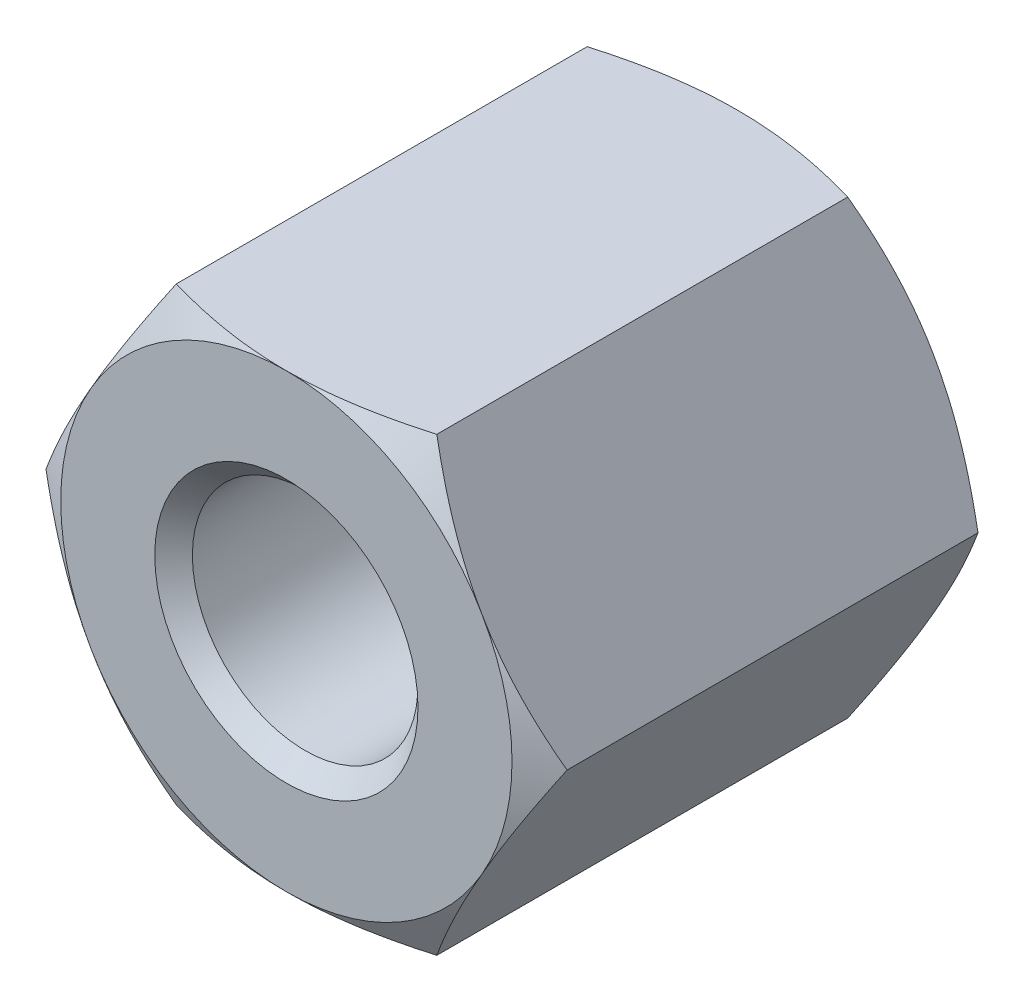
ISO-10303-21;
HEADER;
FILE_DESCRIPTION(('STEP AP214'),'2;1');
FILE_NAME('part.step','',(''),(''),'','','');
FILE_SCHEMA(('AUTOMOTIVE_DESIGN { 1 0 10303 214 1 1 1 1 }'));
ENDSEC;
DATA;
#1=APPLICATION_CONTEXT('core data for automotive mechanical design processes');
#2=APPLICATION_PROTOCOL_DEFINITION('international standard','automotive_design',2000,#1);
#3=PRODUCT_CONTEXT('',#1,'mechanical');
#4=PRODUCT('Part','Part','',(#3));
#5=PRODUCT_RELATED_PRODUCT_CATEGORY('part','',(#4));
#6=PRODUCT_DEFINITION_FORMATION('','',#4);
#7=PRODUCT_DEFINITION_CONTEXT('part definition',#1,'design');
#8=PRODUCT_DEFINITION('design','',#6,#7);
#9=PRODUCT_DEFINITION_SHAPE('','',#8);
#10=(LENGTH_UNIT() NAMED_UNIT(*) SI_UNIT(.MILLI.,.METRE.));
#11=(NAMED_UNIT(*) PLANE_ANGLE_UNIT() SI_UNIT($,.RADIAN.));
#12=(NAMED_UNIT(*) SI_UNIT($,.STERADIAN.) SOLID_ANGLE_UNIT());
#13=UNCERTAINTY_MEASURE_WITH_UNIT(LENGTH_MEASURE(1.E-05),#10,'distance_accuracy_value','');
#14=(GEOMETRIC_REPRESENTATION_CONTEXT(3) GLOBAL_UNCERTAINTY_ASSIGNED_CONTEXT((#13)) GLOBAL_UNIT_ASSIGNED_CONTEXT((#10,
#11,#12)) REPRESENTATION_CONTEXT('',''));
#15=CARTESIAN_POINT('',(0.,0.,0.));
#16=DIRECTION('',(0.,0.,1.));
#17=DIRECTION('',(1.,0.,0.));
#18=AXIS2_PLACEMENT_3D('',#15,#16,#17);
#19=CARTESIAN_POINT('',(3.46410161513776,0.,-3.));
#20=DIRECTION('',(0.866025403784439,0.5,0.));
#21=DIRECTION('',(-0.5,0.866025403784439,0.));
#22=AXIS2_PLACEMENT_3D('',#19,#20,#21);
#23=PLANE('',#22);
#24=CARTESIAN_POINT('',(3.46421708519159,-0.000199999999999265,2.73198413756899));
#25=CARTESIAN_POINT('',(3.38810199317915,0.131635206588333,2.7759462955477));
#26=CARTESIAN_POINT('',(3.31132988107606,0.26460840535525,2.81592841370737));
#27=CARTESIAN_POINT('',(3.15645624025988,0.532857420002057,2.88571791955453));
#28=CARTESIAN_POINT('',(3.078351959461,0.668138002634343,2.91550061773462));
#29=CARTESIAN_POINT('',(2.92311136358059,0.937022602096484,2.96186216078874));
#30=CARTESIAN_POINT('',(2.84599893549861,1.07058524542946,2.97874955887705));
#31=CARTESIAN_POINT('',(2.6914112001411,1.33833905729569,2.99891035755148));
#32=CARTESIAN_POINT('',(2.61393645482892,1.47252925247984,3.00220045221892));
#33=CARTESIAN_POINT('',(2.46916798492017,1.72327559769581,2.99535946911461));
#34=CARTESIAN_POINT('',(2.40185259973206,1.83986926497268,2.98690808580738));
#35=CARTESIAN_POINT('',(2.2676603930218,2.07229698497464,2.96012105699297));
#36=CARTESIAN_POINT('',(2.2007840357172,2.18813023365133,2.94177625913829));
#37=CARTESIAN_POINT('',(2.06631510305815,2.42103725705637,2.89591524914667));
#38=CARTESIAN_POINT('',(1.99873954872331,2.53808155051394,2.86820461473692));
#39=CARTESIAN_POINT('',(1.86459637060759,2.77042435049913,2.8053122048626));
#40=CARTESIAN_POINT('',(1.79802702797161,2.88572583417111,2.77014520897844));
#41=CARTESIAN_POINT('',(1.73193533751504,3.0002,2.73198413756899));
#42=B_SPLINE_CURVE_WITH_KNOTS('',3,(#24,#25,#26,#27,#28,#29,#30,#31,#32,#33,#34,#35,#36,#37,#38,
#39,#40,#41),.UNSPECIFIED.,.F.,.F.,(4,2,2,2,2,2,2,2,4),(0.,0.475539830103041,0.952222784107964,
1.41710776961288,1.88142182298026,2.28572436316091,2.69040156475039,3.10405572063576,
3.5168974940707),.UNSPECIFIED.);
#43=CARTESIAN_POINT('',(3.46410161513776,0.,2.73205080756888));
#44=VERTEX_POINT('',#43);
#45=CARTESIAN_POINT('',(2.59807621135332,1.5,3.));
#46=VERTEX_POINT('',#45);
#47=EDGE_CURVE('E127',#44,#46,#42,.T.);
#48=ORIENTED_EDGE('',*,*,#47,.F.);
#49=DIRECTION('',(0.,0.,1.));
#50=VECTOR('',#49,1.);
#51=CARTESIAN_POINT('',(3.46410161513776,0.,-3.));
#52=LINE('',#51,#50);
#53=CARTESIAN_POINT('',(3.46410161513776,0.,-2.73205080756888));
#54=VERTEX_POINT('',#53);
#55=EDGE_CURVE('E568',#54,#44,#52,.T.);
#56=ORIENTED_EDGE('',*,*,#55,.F.);
#57=CARTESIAN_POINT('',(3.46421708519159,-0.000199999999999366,-2.73198413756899));
#58=CARTESIAN_POINT('',(3.38810199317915,0.131635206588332,-2.77594629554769));
#59=CARTESIAN_POINT('',(3.31132988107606,0.26460840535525,-2.81592841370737));
#60=CARTESIAN_POINT('',(3.15645624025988,0.532857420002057,-2.88571791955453));
#61=CARTESIAN_POINT('',(3.078351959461,0.668138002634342,-2.91550061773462));
#62=CARTESIAN_POINT('',(2.92311136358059,0.937022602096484,-2.96186216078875));
#63=CARTESIAN_POINT('',(2.84599893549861,1.07058524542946,-2.97874955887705));
#64=CARTESIAN_POINT('',(2.6914112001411,1.33833905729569,-2.99891035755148));
#65=CARTESIAN_POINT('',(2.61393645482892,1.47252925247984,-3.00220045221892));
#66=CARTESIAN_POINT('',(2.46916798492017,1.72327559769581,-2.99535946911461));
#67=CARTESIAN_POINT('',(2.40185259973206,1.83986926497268,-2.98690808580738));
#68=CARTESIAN_POINT('',(2.2676603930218,2.07229698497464,-2.96012105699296));
#69=CARTESIAN_POINT('',(2.2007840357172,2.18813023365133,-2.94177625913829));
#70=CARTESIAN_POINT('',(2.06631510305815,2.42103725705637,-2.89591524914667));
#71=CARTESIAN_POINT('',(1.99873954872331,2.53808155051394,-2.86820461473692));
#72=CARTESIAN_POINT('',(1.86459637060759,2.77042435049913,-2.8053122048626));
#73=CARTESIAN_POINT('',(1.79802702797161,2.88572583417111,-2.77014520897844));
#74=CARTESIAN_POINT('',(1.73193533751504,3.0002,-2.73198413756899));
#75=B_SPLINE_CURVE_WITH_KNOTS('',3,(#57,#58,#59,#60,#61,#62,#63,#64,#65,#66,#67,#68,#69,#70,#71,
#72,#73,#74),.UNSPECIFIED.,.F.,.F.,(4,2,2,2,2,2,2,2,4),(0.,0.475539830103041,0.952222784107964,
1.41710776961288,1.88142182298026,2.28572436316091,2.69040156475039,3.10405572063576,
3.5168974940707),.UNSPECIFIED.);
#76=CARTESIAN_POINT('',(2.59807621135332,1.5,-3.));
#77=VERTEX_POINT('',#76);
#78=EDGE_CURVE('E540',#54,#77,#75,.T.);
#79=ORIENTED_EDGE('',*,*,#78,.T.);
#80=CARTESIAN_POINT('',(1.73205080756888,3.,-2.73205080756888));
#81=VERTEX_POINT('',#80);
#82=EDGE_CURVE('E269',#77,#81,#75,.T.);
#83=ORIENTED_EDGE('',*,*,#82,.T.);
#84=DIRECTION('',(0.,0.,1.));
#85=VECTOR('',#84,1.);
#86=CARTESIAN_POINT('',(1.73205080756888,3.,-3.));
#87=LINE('',#86,#85);
#88=CARTESIAN_POINT('',(1.73205080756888,3.,2.73205080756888));
#89=VERTEX_POINT('',#88);
#90=EDGE_CURVE('E159',#81,#89,#87,.T.);
#91=ORIENTED_EDGE('',*,*,#90,.T.);
#92=EDGE_CURVE('E140',#46,#89,#42,.T.);
#93=ORIENTED_EDGE('',*,*,#92,.F.);
#94=EDGE_LOOP('',(#48,#56,#79,#83,#91,#93));
#95=FACE_BOUND('',#94,.T.);
#96=ADVANCED_FACE('F41',(#95),#23,.T.);
#97=CARTESIAN_POINT('',(1.73205080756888,-3.,-3.));
#98=DIRECTION('',(0.866025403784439,-0.5,0.));
#99=DIRECTION('',(0.5,0.866025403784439,0.));
#100=AXIS2_PLACEMENT_3D('',#97,#98,#99);
#101=PLANE('',#100);
#102=CARTESIAN_POINT('',(1.73193533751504,-3.0002,2.73198413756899));
#103=CARTESIAN_POINT('',(1.80805042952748,-2.86836479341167,2.77594629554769));
#104=CARTESIAN_POINT('',(1.88482254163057,-2.73539159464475,2.81592841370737));
#105=CARTESIAN_POINT('',(2.03969618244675,-2.46714257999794,2.88571791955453));
#106=CARTESIAN_POINT('',(2.11780046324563,-2.33186199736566,2.91550061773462));
#107=CARTESIAN_POINT('',(2.27304105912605,-2.06297739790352,2.96186216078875));
#108=CARTESIAN_POINT('',(2.35015348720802,-1.92941475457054,2.97874955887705));
#109=CARTESIAN_POINT('',(2.50474122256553,-1.66166094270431,2.99891035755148));
#110=CARTESIAN_POINT('',(2.58221596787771,-1.52747074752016,3.00220045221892));
#111=CARTESIAN_POINT('',(2.72698443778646,-1.27672440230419,2.99535946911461));
#112=CARTESIAN_POINT('',(2.79429982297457,-1.16013073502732,2.98690808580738));
#113=CARTESIAN_POINT('',(2.92849202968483,-0.927703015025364,2.96012105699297));
#114=CARTESIAN_POINT('',(2.99536838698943,-0.811869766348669,2.94177625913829));
#115=CARTESIAN_POINT('',(3.12983731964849,-0.578962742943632,2.89591524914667));
#116=CARTESIAN_POINT('',(3.19741287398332,-0.461918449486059,2.86820461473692));
#117=CARTESIAN_POINT('',(3.33155605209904,-0.229575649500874,2.8053122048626));
#118=CARTESIAN_POINT('',(3.39812539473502,-0.114274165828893,2.77014520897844));
#119=CARTESIAN_POINT('',(3.46421708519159,0.000200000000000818,2.73198413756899));
#120=B_SPLINE_CURVE_WITH_KNOTS('',3,(#102,#103,#104,#105,#106,#107,#108,#109,#110,#111,#112,
#113,#114,#115,#116,#117,#118,#119),.UNSPECIFIED.,.F.,.F.,(4,2,2,2,2,2,2,2,4),(0.,
0.47553983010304,0.952222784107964,1.41710776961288,1.88142182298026,2.28572436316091,
2.69040156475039,3.10405572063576,3.5168974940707),.UNSPECIFIED.);
#121=CARTESIAN_POINT('',(1.73205080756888,-3.,2.73205080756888));
#122=VERTEX_POINT('',#121);
#123=CARTESIAN_POINT('',(2.59807621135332,-1.5,3.));
#124=VERTEX_POINT('',#123);
#125=EDGE_CURVE('E531',#122,#124,#120,.T.);
#126=ORIENTED_EDGE('',*,*,#125,.F.);
#127=DIRECTION('',(0.,0.,1.));
#128=VECTOR('',#127,1.);
#129=CARTESIAN_POINT('',(1.73205080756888,-3.,-3.));
#130=LINE('',#129,#128);
#131=CARTESIAN_POINT('',(1.73205080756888,-3.,-2.73205080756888));
#132=VERTEX_POINT('',#131);
#133=EDGE_CURVE('E283',#132,#122,#130,.T.);
#134=ORIENTED_EDGE('',*,*,#133,.F.);
#135=CARTESIAN_POINT('',(1.73193533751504,-3.0002,-2.73198413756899));
#136=CARTESIAN_POINT('',(1.80805042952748,-2.86836479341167,-2.77594629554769));
#137=CARTESIAN_POINT('',(1.88482254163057,-2.73539159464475,-2.81592841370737));
#138=CARTESIAN_POINT('',(2.03969618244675,-2.46714257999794,-2.88571791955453));
#139=CARTESIAN_POINT('',(2.11780046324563,-2.33186199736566,-2.91550061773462));
#140=CARTESIAN_POINT('',(2.27304105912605,-2.06297739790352,-2.96186216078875));
#141=CARTESIAN_POINT('',(2.35015348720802,-1.92941475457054,-2.97874955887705));
#142=CARTESIAN_POINT('',(2.50474122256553,-1.66166094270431,-2.99891035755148));
#143=CARTESIAN_POINT('',(2.58221596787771,-1.52747074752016,-3.00220045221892));
#144=CARTESIAN_POINT('',(2.72698443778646,-1.27672440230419,-2.99535946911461));
#145=CARTESIAN_POINT('',(2.79429982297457,-1.16013073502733,-2.98690808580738));
#146=CARTESIAN_POINT('',(2.92849202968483,-0.927703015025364,-2.96012105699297));
#147=CARTESIAN_POINT('',(2.99536838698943,-0.811869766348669,-2.94177625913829));
#148=CARTESIAN_POINT('',(3.12983731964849,-0.578962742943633,-2.89591524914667));
#149=CARTESIAN_POINT('',(3.19741287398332,-0.461918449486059,-2.86820461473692));
#150=CARTESIAN_POINT('',(3.33155605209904,-0.229575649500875,-2.8053122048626));
#151=CARTESIAN_POINT('',(3.39812539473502,-0.114274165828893,-2.77014520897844));
#152=CARTESIAN_POINT('',(3.46421708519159,0.000200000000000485,-2.73198413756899));
#153=B_SPLINE_CURVE_WITH_KNOTS('',3,(#135,#136,#137,#138,#139,#140,#141,#142,#143,#144,#145,
#146,#147,#148,#149,#150,#151,#152),.UNSPECIFIED.,.F.,.F.,(4,2,2,2,2,2,2,2,4),(0.,
0.47553983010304,0.952222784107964,1.41710776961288,1.88142182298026,2.28572436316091,
2.69040156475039,3.10405572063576,3.5168974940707),.UNSPECIFIED.);
#154=CARTESIAN_POINT('',(2.59807621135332,-1.5,-3.));
#155=VERTEX_POINT('',#154);
#156=EDGE_CURVE('E569',#132,#155,#153,.T.);
#157=ORIENTED_EDGE('',*,*,#156,.T.);
#158=EDGE_CURVE('E284',#155,#54,#153,.T.);
#159=ORIENTED_EDGE('',*,*,#158,.T.);
#160=ORIENTED_EDGE('',*,*,#55,.T.);
#161=EDGE_CURVE('E132',#124,#44,#120,.T.);
#162=ORIENTED_EDGE('',*,*,#161,.F.);
#163=EDGE_LOOP('',(#126,#134,#157,#159,#160,#162));
#164=FACE_BOUND('',#163,.T.);
#165=ADVANCED_FACE('F254',(#164),#101,.T.);
#166=CARTESIAN_POINT('',(-1.73205080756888,-3.,-3.));
#167=DIRECTION('',(0.,-1.,0.));
#168=DIRECTION('',(0.,0.,-1.));
#169=AXIS2_PLACEMENT_3D('',#166,#167,#168);
#170=PLANE('',#169);
#171=CARTESIAN_POINT('',(-7.74548365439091,-3.,-0.0635206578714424));
#172=CARTESIAN_POINT('',(-7.57146996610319,-3.,0.0301558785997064));
#173=CARTESIAN_POINT('',(-7.3972904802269,-3.,0.123526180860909));
#174=CARTESIAN_POINT('',(-7.0485144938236,-3.,0.309494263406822));
#175=CARTESIAN_POINT('',(-6.87391798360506,-3.,0.402092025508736));
#176=CARTESIAN_POINT('',(-6.52407229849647,-3.,0.58643402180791));
#177=CARTESIAN_POINT('',(-6.34882267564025,-3.,0.678177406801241));
#178=CARTESIAN_POINT('',(-5.99771962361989,-3.,0.860498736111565));
#179=CARTESIAN_POINT('',(-5.82186619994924,-3.,0.951076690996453));
#180=CARTESIAN_POINT('',(-5.46231182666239,-3.,1.13439221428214));
#181=CARTESIAN_POINT('',(-5.27858020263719,-3.,1.22706972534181));
#182=CARTESIAN_POINT('',(-4.91010340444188,-3.,1.41038621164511));
#183=CARTESIAN_POINT('',(-4.72535824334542,-3.,1.50102521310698));
#184=CARTESIAN_POINT('',(-4.35463989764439,-3.,1.67959630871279));
#185=CARTESIAN_POINT('',(-4.16866716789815,-3.,1.76752934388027));
#186=CARTESIAN_POINT('',(-3.79507118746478,-3.,1.93980441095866));
#187=CARTESIAN_POINT('',(-3.60744803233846,-3.,2.02414664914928));
#188=CARTESIAN_POINT('',(-3.21921577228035,-3.,2.19262921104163));
#189=CARTESIAN_POINT('',(-3.0184798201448,-3.,2.27647962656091));
#190=CARTESIAN_POINT('',(-2.61381768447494,-3.,2.43638442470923));
#191=CARTESIAN_POINT('',(-2.40989060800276,-3.,2.51243657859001));
#192=CARTESIAN_POINT('',(-2.00053042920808,-3.,2.65237011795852));
#193=CARTESIAN_POINT('',(-1.79514384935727,-3.,2.71638511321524));
#194=CARTESIAN_POINT('',(-1.38002064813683,-3.,2.8284619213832));
#195=CARTESIAN_POINT('',(-1.17028662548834,-3.,2.87653298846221));
#196=CARTESIAN_POINT('',(-0.794006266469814,-3.,2.94264508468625));
#197=CARTESIAN_POINT('',(-0.628232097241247,-3.,2.96498768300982));
#198=CARTESIAN_POINT('',(-0.295337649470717,-3.,2.99421350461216));
#199=CARTESIAN_POINT('',(-0.128217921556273,-3.,3.00110275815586));
#200=CARTESIAN_POINT('',(0.206103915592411,-3.,2.99860539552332));
#201=CARTESIAN_POINT('',(0.373305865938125,-3.,2.98919838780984));
#202=CARTESIAN_POINT('',(0.706141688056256,-3.,2.95518699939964));
#203=CARTESIAN_POINT('',(0.871775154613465,-3.,2.93057879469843));
#204=CARTESIAN_POINT('',(1.2182340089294,-3.,2.86528769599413));
#205=CARTESIAN_POINT('',(1.39878062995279,-3.,2.82316231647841));
#206=CARTESIAN_POINT('',(1.75671584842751,-3.,2.72698316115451));
#207=CARTESIAN_POINT('',(1.93410214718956,-3.,2.67292105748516));
#208=CARTESIAN_POINT('',(2.28638755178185,-3.,2.55591066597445));
#209=CARTESIAN_POINT('',(2.46127894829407,-3.,2.49293952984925));
#210=CARTESIAN_POINT('',(2.80855860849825,-3.,2.36062387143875));
#211=CARTESIAN_POINT('',(2.98094745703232,-3.,2.29128086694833));
#212=CARTESIAN_POINT('',(3.32628458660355,-3.,2.14684908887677));
#213=CARTESIAN_POINT('',(3.49920347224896,-3.,2.07169053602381));
#214=CARTESIAN_POINT('',(3.84343885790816,-3.,1.91779095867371));
#215=CARTESIAN_POINT('',(4.01475529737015,-3.,1.83904979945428));
#216=CARTESIAN_POINT('',(4.35585639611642,-3.,1.67898476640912));
#217=CARTESIAN_POINT('',(4.52564298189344,-3.,1.597664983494));
#218=CARTESIAN_POINT('',(4.86420703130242,-3.,1.43294915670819));
#219=CARTESIAN_POINT('',(5.03298447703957,-3.,1.34955307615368));
#220=CARTESIAN_POINT('',(5.4174896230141,-3.,1.1572542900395));
#221=CARTESIAN_POINT('',(5.63295451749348,-3.,1.04782684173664));
#222=CARTESIAN_POINT('',(6.06286115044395,-3.,0.826981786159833));
#223=CARTESIAN_POINT('',(6.27730288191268,-3.,0.715564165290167));
#224=CARTESIAN_POINT('',(6.70107258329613,-3.,0.493473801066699));
#225=CARTESIAN_POINT('',(6.91041645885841,-3.,0.382831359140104));
#226=CARTESIAN_POINT('',(7.32841241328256,-3.,0.160428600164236));
#227=CARTESIAN_POINT('',(7.53706471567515,-3.,0.0486687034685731));
#228=CARTESIAN_POINT('',(7.74548365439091,-3.,-0.0635206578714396));
#229=B_SPLINE_CURVE_WITH_KNOTS('',3,(#171,#172,#173,#174,#175,#176,#177,#178,#179,#180,#181,
#182,#183,#184,#185,#186,#187,#188,#189,#190,#191,#192,#193,#194,#195,#196,#197,#198,#199,#200,
#201,#202,#203,#204,#205,#206,#207,#208,#209,#210,#211,#212,#213,#214,#215,#216,#217,#218,#219,
#220,#221,#222,#223,#224,#225,#226,#227,#228),.UNSPECIFIED.,.F.,.F.,(4,2,2,2,2,2,2,2,2,2,2,2,2,
2,2,2,2,2,2,2,2,2,2,2,2,2,2,2,4),(0.,0.592879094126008,1.18577210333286,1.77920221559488,
2.37262694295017,2.98996472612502,3.60729456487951,4.22440723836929,4.8414844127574,
5.4940087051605,6.14671897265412,6.79169049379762,7.43628700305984,7.93748287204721,
8.43848312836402,8.94011073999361,9.44186459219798,9.99750279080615,10.5535298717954,
11.1110097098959,11.6683570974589,12.2339427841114,12.7995497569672,13.3643003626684,
13.9290609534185,14.6540258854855,15.3789957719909,16.0893434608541,16.7994333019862),.UNSPECIFIED.);
#230=CARTESIAN_POINT('',(-1.73205080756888,-3.,2.73205080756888));
#231=VERTEX_POINT('',#230);
#232=CARTESIAN_POINT('',(0.,-3.,3.));
#233=VERTEX_POINT('',#232);
#234=EDGE_CURVE('E555',#231,#233,#229,.T.);
#235=ORIENTED_EDGE('',*,*,#234,.F.);
#236=DIRECTION('',(0.,0.,1.));
#237=VECTOR('',#236,1.);
#238=CARTESIAN_POINT('',(-1.73205080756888,-3.,-3.));
#239=LINE('',#238,#237);
#240=CARTESIAN_POINT('',(-1.73205080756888,-3.,-2.73205080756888));
#241=VERTEX_POINT('',#240);
#242=EDGE_CURVE('E557',#241,#231,#239,.T.);
#243=ORIENTED_EDGE('',*,*,#242,.F.);
#244=CARTESIAN_POINT('',(-6.16788179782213,-3.,-0.772136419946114));
#245=CARTESIAN_POINT('',(-6.02422581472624,-3.,-0.846712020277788));
#246=CARTESIAN_POINT('',(-5.88037224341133,-3.,-0.920910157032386));
#247=CARTESIAN_POINT('',(-5.59217732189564,-3.,-1.0683582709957));
#248=CARTESIAN_POINT('',(-5.44783596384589,-3.,-1.14160823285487));
#249=CARTESIAN_POINT('',(-5.15834899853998,-3.,-1.28707916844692));
#250=CARTESIAN_POINT('',(-5.01320248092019,-3.,-1.35929833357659));
#251=CARTESIAN_POINT('',(-4.7222107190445,-3.,-1.50232217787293));
#252=CARTESIAN_POINT('',(-4.57636546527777,-3.,-1.57312683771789));
#253=CARTESIAN_POINT('',(-4.27572207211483,-3.,-1.71685048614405));
#254=CARTESIAN_POINT('',(-4.12087581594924,-3.,-1.78966909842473));
#255=CARTESIAN_POINT('',(-3.81002771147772,-3.,-1.93279422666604));
#256=CARTESIAN_POINT('',(-3.65402589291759,-3.,-2.00310080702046));
#257=CARTESIAN_POINT('',(-3.34069233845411,-3.,-2.14040926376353));
#258=CARTESIAN_POINT('',(-3.18336157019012,-3.,-2.20741333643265));
#259=CARTESIAN_POINT('',(-2.86689802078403,-3.,-2.33714761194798));
#260=CARTESIAN_POINT('',(-2.70776485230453,-3.,-2.39987687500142));
#261=CARTESIAN_POINT('',(-2.36683864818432,-3.,-2.52728930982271));
#262=CARTESIAN_POINT('',(-2.18475109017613,-3.,-2.59119583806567));
#263=CARTESIAN_POINT('',(-1.81738028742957,-3.,-2.7088910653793));
#264=CARTESIAN_POINT('',(-1.632098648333,-3.,-2.76268469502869));
#265=CARTESIAN_POINT('',(-1.26165659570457,-3.,-2.85547519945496));
#266=CARTESIAN_POINT('',(-1.07656745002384,-3.,-2.89474576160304));
#267=CARTESIAN_POINT('',(-0.796849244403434,-3.,-2.94068610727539));
#268=CARTESIAN_POINT('',(-0.70327251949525,-3.,-2.95383792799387));
#269=CARTESIAN_POINT('',(-0.515580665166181,-3.,-2.97540852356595));
#270=CARTESIAN_POINT('',(-0.421465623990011,-3.,-2.98382805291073));
#271=CARTESIAN_POINT('',(-0.231434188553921,-3.,-2.99572308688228));
#272=CARTESIAN_POINT('',(-0.135512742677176,-3.,-2.99911875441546));
#273=CARTESIAN_POINT('',(0.0563707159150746,-3.,-3.00057990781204));
#274=CARTESIAN_POINT('',(0.152332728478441,-3.,-2.9986454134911));
#275=CARTESIAN_POINT('',(0.344018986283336,-3.,-2.98952155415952));
#276=CARTESIAN_POINT('',(0.439743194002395,-3.,-2.98233140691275));
#277=CARTESIAN_POINT('',(0.630692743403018,-3.,-2.96297149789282));
#278=CARTESIAN_POINT('',(0.725917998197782,-3.,-2.95080089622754));
#279=CARTESIAN_POINT('',(1.01449835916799,-3.,-2.90682401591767));
#280=CARTESIAN_POINT('',(1.20676490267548,-3.,-2.86776877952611));
#281=CARTESIAN_POINT('',(1.58764028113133,-3.,-2.77495872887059));
#282=CARTESIAN_POINT('',(1.77624758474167,-3.,-2.72119789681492));
#283=CARTESIAN_POINT('',(2.15226695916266,-3.,-2.60232311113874));
#284=CARTESIAN_POINT('',(2.33963795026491,-3.,-2.53708140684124));
#285=CARTESIAN_POINT('',(2.71150558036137,-3.,-2.39881044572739));
#286=CARTESIAN_POINT('',(2.89600132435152,-3.,-2.32577881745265));
#287=CARTESIAN_POINT('',(3.26290797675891,-3.,-2.17404494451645));
#288=CARTESIAN_POINT('',(3.44531585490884,-3.,-2.09533543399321));
#289=CARTESIAN_POINT('',(3.80828668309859,-3.,-1.93385588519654));
#290=CARTESIAN_POINT('',(3.98884986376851,-3.,-1.85108636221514));
#291=CARTESIAN_POINT('',(4.33752623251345,-3.,-1.68768839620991));
#292=CARTESIAN_POINT('',(4.50572404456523,-3.,-1.60723977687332));
#293=CARTESIAN_POINT('',(4.84112403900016,-3.,-1.44428125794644));
#294=CARTESIAN_POINT('',(5.00832618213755,-3.,-1.36177127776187));
#295=CARTESIAN_POINT('',(5.34129694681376,-3.,-1.19545697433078));
#296=CARTESIAN_POINT('',(5.50706859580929,-3.,-1.1116586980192));
#297=CARTESIAN_POINT('',(5.83793978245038,-3.,-0.942782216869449));
#298=CARTESIAN_POINT('',(6.00303938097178,-3.,-0.857704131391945));
#299=CARTESIAN_POINT('',(6.16788179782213,-3.,-0.772136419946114));
#300=B_SPLINE_CURVE_WITH_KNOTS('',3,(#244,#245,#246,#247,#248,#249,#250,#251,#252,#253,#254,
#255,#256,#257,#258,#259,#260,#261,#262,#263,#264,#265,#266,#267,#268,#269,#270,#271,#272,#273,
#274,#275,#276,#277,#278,#279,#280,#281,#282,#283,#284,#285,#286,#287,#288,#289,#290,#291,#292,
#293,#294,#295,#296,#297,#298,#299),.UNSPECIFIED.,.F.,.F.,(4,2,2,2,2,2,2,2,2,2,2,2,2,2,2,2,2,2,
2,2,2,2,2,2,2,2,2,4),(0.,0.485580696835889,0.971169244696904,1.45752499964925,1.94388739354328,
2.45721116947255,2.97052177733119,3.48348627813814,3.99656318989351,4.57527710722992,
5.15370813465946,5.72060393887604,6.0039913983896,6.28733366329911,6.57513204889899,
6.86292936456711,7.15076952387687,7.43865824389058,8.02637689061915,8.61433640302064,
9.20930790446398,9.80446105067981,10.4003897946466,10.9962430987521,11.5555668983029,
12.1149126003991,12.6721511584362,13.2293380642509),.UNSPECIFIED.);
#301=CARTESIAN_POINT('',(0.,-3.,-3.));
#302=VERTEX_POINT('',#301);
#303=EDGE_CURVE('E565',#241,#302,#300,.T.);
#304=ORIENTED_EDGE('',*,*,#303,.T.);
#305=EDGE_CURVE('E259',#302,#132,#300,.T.);
#306=ORIENTED_EDGE('',*,*,#305,.T.);
#307=ORIENTED_EDGE('',*,*,#133,.T.);
#308=EDGE_CURVE('E138',#233,#122,#229,.T.);
#309=ORIENTED_EDGE('',*,*,#308,.F.);
#310=EDGE_LOOP('',(#235,#243,#304,#306,#307,#309));
#311=FACE_BOUND('',#310,.T.);
#312=ADVANCED_FACE('F292',(#311),#170,.T.);
#313=CARTESIAN_POINT('',(-3.46410161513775,0.,-3.));
#314=DIRECTION('',(-0.866025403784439,-0.5,0.));
#315=DIRECTION('',(0.5,-0.866025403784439,0.));
#316=AXIS2_PLACEMENT_3D('',#313,#314,#315);
#317=PLANE('',#316);
#318=CARTESIAN_POINT('',(-3.46421708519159,0.000200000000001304,2.73198413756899));
#319=CARTESIAN_POINT('',(-3.38810199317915,-0.131635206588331,2.7759462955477));
#320=CARTESIAN_POINT('',(-3.31132988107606,-0.264608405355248,2.81592841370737));
#321=CARTESIAN_POINT('',(-3.15645624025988,-0.532857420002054,2.88571791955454));
#322=CARTESIAN_POINT('',(-3.078351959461,-0.66813800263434,2.91550061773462));
#323=CARTESIAN_POINT('',(-2.92311136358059,-0.937022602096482,2.96186216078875));
#324=CARTESIAN_POINT('',(-2.84599893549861,-1.07058524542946,2.97874955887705));
#325=CARTESIAN_POINT('',(-2.6914112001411,-1.33833905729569,2.99891035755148));
#326=CARTESIAN_POINT('',(-2.61393645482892,-1.47252925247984,3.00220045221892));
#327=CARTESIAN_POINT('',(-2.46916798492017,-1.72327559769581,2.99535946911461));
#328=CARTESIAN_POINT('',(-2.40185259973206,-1.83986926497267,2.98690808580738));
#329=CARTESIAN_POINT('',(-2.2676603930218,-2.07229698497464,2.96012105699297));
#330=CARTESIAN_POINT('',(-2.2007840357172,-2.18813023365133,2.94177625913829));
#331=CARTESIAN_POINT('',(-2.06631510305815,-2.42103725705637,2.89591524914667));
#332=CARTESIAN_POINT('',(-1.99873954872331,-2.53808155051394,2.86820461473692));
#333=CARTESIAN_POINT('',(-1.86459637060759,-2.77042435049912,2.8053122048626));
#334=CARTESIAN_POINT('',(-1.79802702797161,-2.88572583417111,2.77014520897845));
#335=CARTESIAN_POINT('',(-1.73193533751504,-3.0002,2.73198413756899));
#336=B_SPLINE_CURVE_WITH_KNOTS('',3,(#318,#319,#320,#321,#322,#323,#324,#325,#326,#327,#328,
#329,#330,#331,#332,#333,#334,#335),.UNSPECIFIED.,.F.,.F.,(4,2,2,2,2,2,2,2,4),(0.,
0.475539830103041,0.952222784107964,1.41710776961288,1.88142182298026,2.28572436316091,
2.69040156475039,3.10405572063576,3.5168974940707),.UNSPECIFIED.);
#337=CARTESIAN_POINT('',(-3.46410161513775,0.,2.73205080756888));
#338=VERTEX_POINT('',#337);
#339=CARTESIAN_POINT('',(-2.59807621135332,-1.5,3.));
#340=VERTEX_POINT('',#339);
#341=EDGE_CURVE('E176',#338,#340,#336,.T.);
#342=ORIENTED_EDGE('',*,*,#341,.F.);
#343=DIRECTION('',(0.,0.,1.));
#344=VECTOR('',#343,1.);
#345=CARTESIAN_POINT('',(-3.46410161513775,0.,-3.));
#346=LINE('',#345,#344);
#347=CARTESIAN_POINT('',(-3.46410161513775,0.,-2.73205080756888));
#348=VERTEX_POINT('',#347);
#349=EDGE_CURVE('E552',#348,#338,#346,.T.);
#350=ORIENTED_EDGE('',*,*,#349,.F.);
#351=CARTESIAN_POINT('',(-3.46421708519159,0.000200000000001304,-2.73198413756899));
#352=CARTESIAN_POINT('',(-3.38810199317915,-0.131635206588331,-2.7759462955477));
#353=CARTESIAN_POINT('',(-3.31132988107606,-0.264608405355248,-2.81592841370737));
#354=CARTESIAN_POINT('',(-3.15645624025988,-0.532857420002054,-2.88571791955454));
#355=CARTESIAN_POINT('',(-3.078351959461,-0.66813800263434,-2.91550061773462));
#356=CARTESIAN_POINT('',(-2.92311136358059,-0.937022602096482,-2.96186216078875));
#357=CARTESIAN_POINT('',(-2.84599893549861,-1.07058524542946,-2.97874955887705));
#358=CARTESIAN_POINT('',(-2.6914112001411,-1.33833905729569,-2.99891035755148));
#359=CARTESIAN_POINT('',(-2.61393645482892,-1.47252925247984,-3.00220045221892));
#360=CARTESIAN_POINT('',(-2.46916798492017,-1.72327559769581,-2.99535946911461));
#361=CARTESIAN_POINT('',(-2.40185259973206,-1.83986926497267,-2.98690808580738));
#362=CARTESIAN_POINT('',(-2.2676603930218,-2.07229698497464,-2.96012105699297));
#363=CARTESIAN_POINT('',(-2.2007840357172,-2.18813023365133,-2.94177625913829));
#364=CARTESIAN_POINT('',(-2.06631510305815,-2.42103725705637,-2.89591524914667));
#365=CARTESIAN_POINT('',(-1.99873954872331,-2.53808155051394,-2.86820461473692));
#366=CARTESIAN_POINT('',(-1.86459637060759,-2.77042435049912,-2.8053122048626));
#367=CARTESIAN_POINT('',(-1.79802702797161,-2.88572583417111,-2.77014520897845));
#368=CARTESIAN_POINT('',(-1.73193533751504,-3.0002,-2.73198413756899));
#369=B_SPLINE_CURVE_WITH_KNOTS('',3,(#351,#352,#353,#354,#355,#356,#357,#358,#359,#360,#361,
#362,#363,#364,#365,#366,#367,#368),.UNSPECIFIED.,.F.,.F.,(4,2,2,2,2,2,2,2,4),(0.,
0.475539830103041,0.952222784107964,1.41710776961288,1.88142182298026,2.28572436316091,
2.69040156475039,3.10405572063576,3.5168974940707),.UNSPECIFIED.);
#370=CARTESIAN_POINT('',(-2.59807621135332,-1.5,-3.));
#371=VERTEX_POINT('',#370);
#372=EDGE_CURVE('E275',#348,#371,#369,.T.);
#373=ORIENTED_EDGE('',*,*,#372,.T.);
#374=EDGE_CURVE('E282',#371,#241,#369,.T.);
#375=ORIENTED_EDGE('',*,*,#374,.T.);
#376=ORIENTED_EDGE('',*,*,#242,.T.);
#377=EDGE_CURVE('E539',#340,#231,#336,.T.);
#378=ORIENTED_EDGE('',*,*,#377,.F.);
#379=EDGE_LOOP('',(#342,#350,#373,#375,#376,#378));
#380=FACE_BOUND('',#379,.T.);
#381=ADVANCED_FACE('F289',(#380),#317,.T.);
#382=CARTESIAN_POINT('',(-1.73205080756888,3.,-3.));
#383=DIRECTION('',(-0.866025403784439,0.5,0.));
#384=DIRECTION('',(-0.5,-0.866025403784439,0.));
#385=AXIS2_PLACEMENT_3D('',#382,#383,#384);
#386=PLANE('',#385);
#387=CARTESIAN_POINT('',(-1.73193533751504,3.0002,2.73198413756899));
#388=CARTESIAN_POINT('',(-1.80805042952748,2.86836479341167,2.77594629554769));
#389=CARTESIAN_POINT('',(-1.88482254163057,2.73539159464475,2.81592841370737));
#390=CARTESIAN_POINT('',(-2.03969618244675,2.46714257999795,2.88571791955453));
#391=CARTESIAN_POINT('',(-2.11780046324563,2.33186199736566,2.91550061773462));
#392=CARTESIAN_POINT('',(-2.27304105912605,2.06297739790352,2.96186216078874));
#393=CARTESIAN_POINT('',(-2.35015348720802,1.92941475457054,2.97874955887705));
#394=CARTESIAN_POINT('',(-2.50474122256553,1.66166094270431,2.99891035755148));
#395=CARTESIAN_POINT('',(-2.58221596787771,1.52747074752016,3.00220045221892));
#396=CARTESIAN_POINT('',(-2.72698443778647,1.27672440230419,2.99535946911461));
#397=CARTESIAN_POINT('',(-2.79429982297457,1.16013073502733,2.98690808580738));
#398=CARTESIAN_POINT('',(-2.92849202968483,0.927703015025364,2.96012105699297));
#399=CARTESIAN_POINT('',(-2.99536838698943,0.81186976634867,2.94177625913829));
#400=CARTESIAN_POINT('',(-3.12983731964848,0.578962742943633,2.89591524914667));
#401=CARTESIAN_POINT('',(-3.19741287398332,0.46191844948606,2.86820461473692));
#402=CARTESIAN_POINT('',(-3.33155605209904,0.229575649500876,2.8053122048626));
#403=CARTESIAN_POINT('',(-3.39812539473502,0.114274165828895,2.77014520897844));
#404=CARTESIAN_POINT('',(-3.46421708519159,-0.000199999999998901,2.73198413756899));
#405=B_SPLINE_CURVE_WITH_KNOTS('',3,(#387,#388,#389,#390,#391,#392,#393,#394,#395,#396,#397,
#398,#399,#400,#401,#402,#403,#404),.UNSPECIFIED.,.F.,.F.,(4,2,2,2,2,2,2,2,4),(0.,
0.475539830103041,0.952222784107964,1.41710776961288,1.88142182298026,2.28572436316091,
2.69040156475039,3.10405572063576,3.5168974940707),.UNSPECIFIED.);
#406=CARTESIAN_POINT('',(-1.73205080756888,3.,2.73205080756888));
#407=VERTEX_POINT('',#406);
#408=CARTESIAN_POINT('',(-2.59807621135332,1.5,3.));
#409=VERTEX_POINT('',#408);
#410=EDGE_CURVE('E183',#407,#409,#405,.T.);
#411=ORIENTED_EDGE('',*,*,#410,.F.);
#412=DIRECTION('',(0.,0.,1.));
#413=VECTOR('',#412,1.);
#414=CARTESIAN_POINT('',(-1.73205080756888,3.,-3.));
#415=LINE('',#414,#413);
#416=CARTESIAN_POINT('',(-1.73205080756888,3.,-2.73205080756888));
#417=VERTEX_POINT('',#416);
#418=EDGE_CURVE('E233',#417,#407,#415,.T.);
#419=ORIENTED_EDGE('',*,*,#418,.F.);
#420=CARTESIAN_POINT('',(-1.73193533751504,3.0002,-2.73198413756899));
#421=CARTESIAN_POINT('',(-1.80805042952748,2.86836479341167,-2.77594629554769));
#422=CARTESIAN_POINT('',(-1.88482254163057,2.73539159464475,-2.81592841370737));
#423=CARTESIAN_POINT('',(-2.03969618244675,2.46714257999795,-2.88571791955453));
#424=CARTESIAN_POINT('',(-2.11780046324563,2.33186199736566,-2.91550061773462));
#425=CARTESIAN_POINT('',(-2.27304105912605,2.06297739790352,-2.96186216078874));
#426=CARTESIAN_POINT('',(-2.35015348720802,1.92941475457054,-2.97874955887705));
#427=CARTESIAN_POINT('',(-2.50474122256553,1.66166094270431,-2.99891035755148));
#428=CARTESIAN_POINT('',(-2.58221596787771,1.52747074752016,-3.00220045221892));
#429=CARTESIAN_POINT('',(-2.72698443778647,1.27672440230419,-2.99535946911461));
#430=CARTESIAN_POINT('',(-2.79429982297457,1.16013073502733,-2.98690808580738));
#431=CARTESIAN_POINT('',(-2.92849202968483,0.927703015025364,-2.96012105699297));
#432=CARTESIAN_POINT('',(-2.99536838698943,0.81186976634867,-2.94177625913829));
#433=CARTESIAN_POINT('',(-3.12983731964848,0.578962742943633,-2.89591524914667));
#434=CARTESIAN_POINT('',(-3.19741287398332,0.46191844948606,-2.86820461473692));
#435=CARTESIAN_POINT('',(-3.33155605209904,0.229575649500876,-2.8053122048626));
#436=CARTESIAN_POINT('',(-3.39812539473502,0.114274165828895,-2.77014520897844));
#437=CARTESIAN_POINT('',(-3.46421708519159,-0.000199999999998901,-2.73198413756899));
#438=B_SPLINE_CURVE_WITH_KNOTS('',3,(#420,#421,#422,#423,#424,#425,#426,#427,#428,#429,#430,
#431,#432,#433,#434,#435,#436,#437),.UNSPECIFIED.,.F.,.F.,(4,2,2,2,2,2,2,2,4),(0.,
0.475539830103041,0.952222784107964,1.41710776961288,1.88142182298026,2.28572436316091,
2.69040156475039,3.10405572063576,3.5168974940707),.UNSPECIFIED.);
#439=CARTESIAN_POINT('',(-2.59807621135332,1.5,-3.));
#440=VERTEX_POINT('',#439);
#441=EDGE_CURVE('E237',#417,#440,#438,.T.);
#442=ORIENTED_EDGE('',*,*,#441,.T.);
#443=EDGE_CURVE('E550',#440,#348,#438,.T.);
#444=ORIENTED_EDGE('',*,*,#443,.T.);
#445=ORIENTED_EDGE('',*,*,#349,.T.);
#446=EDGE_CURVE('E527',#409,#338,#405,.T.);
#447=ORIENTED_EDGE('',*,*,#446,.F.);
#448=EDGE_LOOP('',(#411,#419,#442,#444,#445,#447));
#449=FACE_BOUND('',#448,.T.);
#450=ADVANCED_FACE('F218',(#449),#386,.T.);
#451=CARTESIAN_POINT('',(1.73205080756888,3.,-3.));
#452=DIRECTION('',(0.,1.,0.));
#453=DIRECTION('',(-1.,0.,0.));
#454=AXIS2_PLACEMENT_3D('',#451,#452,#453);
#455=PLANE('',#454);
#456=CARTESIAN_POINT('',(7.74548365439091,3.,-0.0635206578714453));
#457=CARTESIAN_POINT('',(7.57146996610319,3.,0.0301558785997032));
#458=CARTESIAN_POINT('',(7.39729048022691,3.,0.123526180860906));
#459=CARTESIAN_POINT('',(7.04851449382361,3.,0.309494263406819));
#460=CARTESIAN_POINT('',(6.87391798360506,3.,0.402092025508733));
#461=CARTESIAN_POINT('',(6.52407229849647,3.,0.586434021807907));
#462=CARTESIAN_POINT('',(6.34882267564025,3.,0.678177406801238));
#463=CARTESIAN_POINT('',(5.99771962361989,3.,0.860498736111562));
#464=CARTESIAN_POINT('',(5.82186619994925,3.,0.95107669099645));
#465=CARTESIAN_POINT('',(5.46231182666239,3.,1.13439221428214));
#466=CARTESIAN_POINT('',(5.27858020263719,3.,1.22706972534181));
#467=CARTESIAN_POINT('',(4.91010340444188,3.,1.41038621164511));
#468=CARTESIAN_POINT('',(4.72535824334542,3.,1.50102521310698));
#469=CARTESIAN_POINT('',(4.3546398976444,3.,1.67959630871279));
#470=CARTESIAN_POINT('',(4.16866716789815,3.,1.76752934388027));
#471=CARTESIAN_POINT('',(3.79507118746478,3.,1.93980441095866));
#472=CARTESIAN_POINT('',(3.60744803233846,3.,2.02414664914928));
#473=CARTESIAN_POINT('',(3.21921577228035,3.,2.19262921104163));
#474=CARTESIAN_POINT('',(3.01847982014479,3.,2.27647962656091));
#475=CARTESIAN_POINT('',(2.61381768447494,3.,2.43638442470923));
#476=CARTESIAN_POINT('',(2.40989060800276,3.,2.51243657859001));
#477=CARTESIAN_POINT('',(2.00053042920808,3.,2.65237011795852));
#478=CARTESIAN_POINT('',(1.79514384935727,3.,2.71638511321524));
#479=CARTESIAN_POINT('',(1.38002064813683,3.,2.8284619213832));
#480=CARTESIAN_POINT('',(1.17028662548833,3.,2.87653298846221));
#481=CARTESIAN_POINT('',(0.794006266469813,3.,2.94264508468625));
#482=CARTESIAN_POINT('',(0.628232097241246,3.,2.96498768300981));
#483=CARTESIAN_POINT('',(0.295337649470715,3.,2.99421350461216));
#484=CARTESIAN_POINT('',(0.128217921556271,3.,3.00110275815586));
#485=CARTESIAN_POINT('',(-0.206103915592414,3.,2.99860539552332));
#486=CARTESIAN_POINT('',(-0.373305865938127,3.,2.98919838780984));
#487=CARTESIAN_POINT('',(-0.706141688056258,3.,2.95518699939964));
#488=CARTESIAN_POINT('',(-0.871775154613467,3.,2.93057879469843));
#489=CARTESIAN_POINT('',(-1.21823400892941,3.,2.86528769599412));
#490=CARTESIAN_POINT('',(-1.39878062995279,3.,2.82316231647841));
#491=CARTESIAN_POINT('',(-1.75671584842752,3.,2.72698316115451));
#492=CARTESIAN_POINT('',(-1.93410214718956,3.,2.67292105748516));
#493=CARTESIAN_POINT('',(-2.28638755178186,3.,2.55591066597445));
#494=CARTESIAN_POINT('',(-2.46127894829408,3.,2.49293952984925));
#495=CARTESIAN_POINT('',(-2.80855860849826,3.,2.36062387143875));
#496=CARTESIAN_POINT('',(-2.98094745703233,3.,2.29128086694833));
#497=CARTESIAN_POINT('',(-3.32628458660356,3.,2.14684908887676));
#498=CARTESIAN_POINT('',(-3.49920347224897,3.,2.0716905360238));
#499=CARTESIAN_POINT('',(-3.84343885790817,3.,1.91779095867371));
#500=CARTESIAN_POINT('',(-4.01475529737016,3.,1.83904979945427));
#501=CARTESIAN_POINT('',(-4.35585639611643,3.,1.67898476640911));
#502=CARTESIAN_POINT('',(-4.52564298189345,3.,1.597664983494));
#503=CARTESIAN_POINT('',(-4.86420703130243,3.,1.43294915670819));
#504=CARTESIAN_POINT('',(-5.03298447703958,3.,1.34955307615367));
#505=CARTESIAN_POINT('',(-5.41748962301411,3.,1.15725429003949));
#506=CARTESIAN_POINT('',(-5.6329545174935,3.,1.04782684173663));
#507=CARTESIAN_POINT('',(-6.06286115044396,3.,0.826981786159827));
#508=CARTESIAN_POINT('',(-6.27730288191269,3.,0.715564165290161));
#509=CARTESIAN_POINT('',(-6.70107258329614,3.,0.493473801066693));
#510=CARTESIAN_POINT('',(-6.91041645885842,3.,0.382831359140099));
#511=CARTESIAN_POINT('',(-7.32841241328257,3.,0.160428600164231));
#512=CARTESIAN_POINT('',(-7.53706471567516,3.,0.0486687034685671));
#513=CARTESIAN_POINT('',(-7.74548365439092,3.,-0.0635206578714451));
#514=B_SPLINE_CURVE_WITH_KNOTS('',3,(#456,#457,#458,#459,#460,#461,#462,#463,#464,#465,#466,
#467,#468,#469,#470,#471,#472,#473,#474,#475,#476,#477,#478,#479,#480,#481,#482,#483,#484,#485,
#486,#487,#488,#489,#490,#491,#492,#493,#494,#495,#496,#497,#498,#499,#500,#501,#502,#503,#504,
#505,#506,#507,#508,#509,#510,#511,#512,#513),.UNSPECIFIED.,.F.,.F.,(4,2,2,2,2,2,2,2,2,2,2,2,2,
2,2,2,2,2,2,2,2,2,2,2,2,2,2,2,4),(0.,0.592879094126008,1.18577210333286,1.77920221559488,
2.37262694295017,2.98996472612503,3.60729456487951,4.2244072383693,4.84148441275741,
5.49400870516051,6.14671897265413,6.79169049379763,7.43628700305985,7.93748287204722,
8.43848312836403,8.94011073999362,9.44186459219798,9.99750279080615,10.5535298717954,
11.1110097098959,11.6683570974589,12.2339427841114,12.7995497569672,13.3643003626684,
13.9290609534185,14.6540258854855,15.3789957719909,16.0893434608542,16.7994333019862),.UNSPECIFIED.);
#515=CARTESIAN_POINT('',(0.,3.,3.));
#516=VERTEX_POINT('',#515);
#517=EDGE_CURVE('E145',#89,#516,#514,.T.);
#518=ORIENTED_EDGE('',*,*,#517,.F.);
#519=ORIENTED_EDGE('',*,*,#90,.F.);
#520=CARTESIAN_POINT('',(6.16788179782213,3.,-0.772136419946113));
#521=CARTESIAN_POINT('',(6.02422581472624,3.,-0.846712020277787));
#522=CARTESIAN_POINT('',(5.88037224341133,3.,-0.920910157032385));
#523=CARTESIAN_POINT('',(5.59217732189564,3.,-1.0683582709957));
#524=CARTESIAN_POINT('',(5.4478359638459,3.,-1.14160823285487));
#525=CARTESIAN_POINT('',(5.15834899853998,3.,-1.28707916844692));
#526=CARTESIAN_POINT('',(5.01320248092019,3.,-1.35929833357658));
#527=CARTESIAN_POINT('',(4.7222107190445,3.,-1.50232217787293));
#528=CARTESIAN_POINT('',(4.57636546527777,3.,-1.57312683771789));
#529=CARTESIAN_POINT('',(4.27572207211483,3.,-1.71685048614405));
#530=CARTESIAN_POINT('',(4.12087581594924,3.,-1.78966909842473));
#531=CARTESIAN_POINT('',(3.81002771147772,3.,-1.93279422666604));
#532=CARTESIAN_POINT('',(3.65402589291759,3.,-2.00310080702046));
#533=CARTESIAN_POINT('',(3.34069233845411,3.,-2.14040926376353));
#534=CARTESIAN_POINT('',(3.18336157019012,3.,-2.20741333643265));
#535=CARTESIAN_POINT('',(2.86689802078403,3.,-2.33714761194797));
#536=CARTESIAN_POINT('',(2.70776485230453,3.,-2.39987687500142));
#537=CARTESIAN_POINT('',(2.36683864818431,3.,-2.52728930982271));
#538=CARTESIAN_POINT('',(2.18475109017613,3.,-2.59119583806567));
#539=CARTESIAN_POINT('',(1.81738028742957,3.,-2.7088910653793));
#540=CARTESIAN_POINT('',(1.632098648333,3.,-2.76268469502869));
#541=CARTESIAN_POINT('',(1.26165659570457,3.,-2.85547519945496));
#542=CARTESIAN_POINT('',(1.07656745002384,3.,-2.89474576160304));
#543=CARTESIAN_POINT('',(0.796849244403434,3.,-2.94068610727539));
#544=CARTESIAN_POINT('',(0.703272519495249,3.,-2.95383792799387));
#545=CARTESIAN_POINT('',(0.515580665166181,3.,-2.97540852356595));
#546=CARTESIAN_POINT('',(0.42146562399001,3.,-2.98382805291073));
#547=CARTESIAN_POINT('',(0.231434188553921,3.,-2.99572308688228));
#548=CARTESIAN_POINT('',(0.135512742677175,3.,-2.99911875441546));
#549=CARTESIAN_POINT('',(-0.0563707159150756,3.,-3.00057990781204));
#550=CARTESIAN_POINT('',(-0.152332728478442,3.,-2.9986454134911));
#551=CARTESIAN_POINT('',(-0.344018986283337,3.,-2.98952155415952));
#552=CARTESIAN_POINT('',(-0.439743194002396,3.,-2.98233140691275));
#553=CARTESIAN_POINT('',(-0.63069274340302,3.,-2.96297149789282));
#554=CARTESIAN_POINT('',(-0.725917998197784,3.,-2.95080089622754));
#555=CARTESIAN_POINT('',(-1.01449835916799,3.,-2.90682401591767));
#556=CARTESIAN_POINT('',(-1.20676490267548,3.,-2.8677687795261));
#557=CARTESIAN_POINT('',(-1.58764028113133,3.,-2.77495872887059));
#558=CARTESIAN_POINT('',(-1.77624758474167,3.,-2.72119789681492));
#559=CARTESIAN_POINT('',(-2.15226695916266,3.,-2.60232311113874));
#560=CARTESIAN_POINT('',(-2.33963795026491,3.,-2.53708140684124));
#561=CARTESIAN_POINT('',(-2.71150558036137,3.,-2.39881044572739));
#562=CARTESIAN_POINT('',(-2.89600132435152,3.,-2.32577881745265));
#563=CARTESIAN_POINT('',(-3.26290797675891,3.,-2.17404494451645));
#564=CARTESIAN_POINT('',(-3.44531585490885,3.,-2.09533543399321));
#565=CARTESIAN_POINT('',(-3.8082866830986,3.,-1.93385588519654));
#566=CARTESIAN_POINT('',(-3.98884986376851,3.,-1.85108636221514));
#567=CARTESIAN_POINT('',(-4.33752623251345,3.,-1.6876883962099));
#568=CARTESIAN_POINT('',(-4.50572404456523,3.,-1.60723977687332));
#569=CARTESIAN_POINT('',(-4.84112403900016,3.,-1.44428125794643));
#570=CARTESIAN_POINT('',(-5.00832618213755,3.,-1.36177127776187));
#571=CARTESIAN_POINT('',(-5.34129694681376,3.,-1.19545697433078));
#572=CARTESIAN_POINT('',(-5.50706859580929,3.,-1.1116586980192));
#573=CARTESIAN_POINT('',(-5.83793978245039,3.,-0.942782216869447));
#574=CARTESIAN_POINT('',(-6.00303938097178,3.,-0.857704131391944));
#575=CARTESIAN_POINT('',(-6.16788179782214,3.,-0.772136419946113));
#576=B_SPLINE_CURVE_WITH_KNOTS('',3,(#520,#521,#522,#523,#524,#525,#526,#527,#528,#529,#530,
#531,#532,#533,#534,#535,#536,#537,#538,#539,#540,#541,#542,#543,#544,#545,#546,#547,#548,#549,
#550,#551,#552,#553,#554,#555,#556,#557,#558,#559,#560,#561,#562,#563,#564,#565,#566,#567,#568,
#569,#570,#571,#572,#573,#574,#575),.UNSPECIFIED.,.F.,.F.,(4,2,2,2,2,2,2,2,2,2,2,2,2,2,2,2,2,2,
2,2,2,2,2,2,2,2,2,4),(0.,0.485580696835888,0.971169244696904,1.45752499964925,1.94388739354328,
2.45721116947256,2.97052177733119,3.48348627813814,3.99656318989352,4.57527710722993,
5.15370813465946,5.72060393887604,6.0039913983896,6.28733366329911,6.575132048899,
6.86292936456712,7.15076952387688,7.43865824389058,8.02637689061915,8.61433640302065,
9.20930790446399,9.80446105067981,10.4003897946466,10.9962430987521,11.5555668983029,
12.1149126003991,12.6721511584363,13.2293380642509),.UNSPECIFIED.);
#577=CARTESIAN_POINT('',(0.,3.,-3.));
#578=VERTEX_POINT('',#577);
#579=EDGE_CURVE('E234',#81,#578,#576,.T.);
#580=ORIENTED_EDGE('',*,*,#579,.T.);
#581=EDGE_CURVE('E223',#578,#417,#576,.T.);
#582=ORIENTED_EDGE('',*,*,#581,.T.);
#583=ORIENTED_EDGE('',*,*,#418,.T.);
#584=EDGE_CURVE('E161',#516,#407,#514,.T.);
#585=ORIENTED_EDGE('',*,*,#584,.F.);
#586=EDGE_LOOP('',(#518,#519,#580,#582,#583,#585));
#587=FACE_BOUND('',#586,.T.);
#588=ADVANCED_FACE('F214',(#587),#455,.T.);
#589=CARTESIAN_POINT('',(0.,0.,-3.));
#590=DIRECTION('',(0.,0.,1.));
#591=DIRECTION('',(-1.,0.,0.));
#592=AXIS2_PLACEMENT_3D('',#589,#590,#591);
#593=CONICAL_SURFACE('',#592,3.,1.0471975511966);
#594=CARTESIAN_POINT('',(0.,0.,-3.));
#595=DIRECTION('',(0.,0.,1.));
#596=DIRECTION('',(1.,0.,0.));
#597=AXIS2_PLACEMENT_3D('',#594,#595,#596);
#598=CIRCLE('',#597,3.);
#599=EDGE_CURVE('E535',#155,#77,#598,.T.);
#600=ORIENTED_EDGE('',*,*,#599,.T.);
#601=ORIENTED_EDGE('',*,*,#78,.F.);
#602=ORIENTED_EDGE('',*,*,#158,.F.);
#603=EDGE_LOOP('',(#600,#601,#602));
#604=FACE_BOUND('',#603,.T.);
#605=ADVANCED_FACE('F217',(#604),#593,.T.);
#606=EDGE_CURVE('E532',#302,#155,#598,.T.);
#607=ORIENTED_EDGE('',*,*,#606,.T.);
#608=ORIENTED_EDGE('',*,*,#156,.F.);
#609=ORIENTED_EDGE('',*,*,#305,.F.);
#610=EDGE_LOOP('',(#607,#608,#609));
#611=FACE_BOUND('',#610,.T.);
#612=ADVANCED_FACE('F337',(#611),#593,.T.);
#613=ORIENTED_EDGE('',*,*,#374,.F.);
#614=EDGE_CURVE('E534',#371,#302,#598,.T.);
#615=ORIENTED_EDGE('',*,*,#614,.T.);
#616=ORIENTED_EDGE('',*,*,#303,.F.);
#617=EDGE_LOOP('',(#613,#615,#616));
#618=FACE_BOUND('',#617,.T.);
#619=ADVANCED_FACE('F251',(#618),#593,.T.);
#620=ORIENTED_EDGE('',*,*,#443,.F.);
#621=EDGE_CURVE('E543',#440,#371,#598,.T.);
#622=ORIENTED_EDGE('',*,*,#621,.T.);
#623=ORIENTED_EDGE('',*,*,#372,.F.);
#624=EDGE_LOOP('',(#620,#622,#623));
#625=FACE_BOUND('',#624,.T.);
#626=ADVANCED_FACE('F249',(#625),#593,.T.);
#627=ORIENTED_EDGE('',*,*,#581,.F.);
#628=CARTESIAN_POINT('',(0.,0.,-3.));
#629=DIRECTION('',(0.,0.,-1.));
#630=DIRECTION('',(-1.,0.,0.));
#631=AXIS2_PLACEMENT_3D('',#628,#629,#630);
#632=CIRCLE('',#631,3.);
#633=EDGE_CURVE('E235',#440,#578,#632,.T.);
#634=ORIENTED_EDGE('',*,*,#633,.F.);
#635=ORIENTED_EDGE('',*,*,#441,.F.);
#636=EDGE_LOOP('',(#627,#634,#635));
#637=FACE_BOUND('',#636,.T.);
#638=ADVANCED_FACE('F243',(#637),#593,.T.);
#639=EDGE_CURVE('E546',#77,#578,#598,.T.);
#640=ORIENTED_EDGE('',*,*,#639,.T.);
#641=ORIENTED_EDGE('',*,*,#579,.F.);
#642=ORIENTED_EDGE('',*,*,#82,.F.);
#643=EDGE_LOOP('',(#640,#641,#642));
#644=FACE_BOUND('',#643,.T.);
#645=ADVANCED_FACE('F248',(#644),#593,.T.);
#646=CARTESIAN_POINT('',(0.,0.,-3.));
#647=DIRECTION('',(0.,0.,1.));
#648=DIRECTION('',(1.,0.,0.));
#649=AXIS2_PLACEMENT_3D('',#646,#647,#648);
#650=PLANE('',#649);
#651=CARTESIAN_POINT('',(0.,0.,-3.));
#652=DIRECTION('',(0.,0.,1.));
#653=DIRECTION('',(1.,0.,0.));
#654=AXIS2_PLACEMENT_3D('',#651,#652,#653);
#655=CIRCLE('',#654,1.75);
#656=CARTESIAN_POINT('',(1.75,0.,-3.));
#657=VERTEX_POINT('',#656);
#658=EDGE_CURVE('E584',#657,#657,#655,.T.);
#659=ORIENTED_EDGE('',*,*,#658,.T.);
#660=EDGE_LOOP('',(#659));
#661=FACE_BOUND('',#660,.T.);
#662=ORIENTED_EDGE('',*,*,#639,.F.);
#663=ORIENTED_EDGE('',*,*,#599,.F.);
#664=ORIENTED_EDGE('',*,*,#606,.F.);
#665=ORIENTED_EDGE('',*,*,#614,.F.);
#666=ORIENTED_EDGE('',*,*,#621,.F.);
#667=ORIENTED_EDGE('',*,*,#633,.T.);
#668=EDGE_LOOP('',(#662,#663,#664,#665,#666,#667));
#669=FACE_BOUND('',#668,.T.);
#670=ADVANCED_FACE('F371',(#661,#669),#650,.F.);
#671=CARTESIAN_POINT('',(0.,0.,0.));
#672=DIRECTION('',(0.,0.,-1.));
#673=DIRECTION('',(-1.,0.,0.));
#674=AXIS2_PLACEMENT_3D('',#671,#672,#673);
#675=CYLINDRICAL_SURFACE('',#674,1.5);
#676=CARTESIAN_POINT('',(0.,0.,2.75));
#677=DIRECTION('',(0.,0.,-1.));
#678=DIRECTION('',(-1.,0.,0.));
#679=AXIS2_PLACEMENT_3D('',#676,#677,#678);
#680=CIRCLE('',#679,1.5);
#681=CARTESIAN_POINT('',(-1.5,0.,2.75));
#682=VERTEX_POINT('',#681);
#683=EDGE_CURVE('E12',#682,#682,#680,.F.);
#684=ORIENTED_EDGE('',*,*,#683,.T.);
#685=EDGE_LOOP('',(#684));
#686=FACE_BOUND('',#685,.T.);
#687=CARTESIAN_POINT('',(0.,0.,-2.75));
#688=DIRECTION('',(0.,0.,1.));
#689=DIRECTION('',(1.,0.,0.));
#690=AXIS2_PLACEMENT_3D('',#687,#688,#689);
#691=CIRCLE('',#690,1.5);
#692=CARTESIAN_POINT('',(1.5,0.,-2.75));
#693=VERTEX_POINT('',#692);
#694=EDGE_CURVE('E538',#693,#693,#691,.F.);
#695=ORIENTED_EDGE('',*,*,#694,.T.);
#696=EDGE_LOOP('',(#695));
#697=FACE_BOUND('',#696,.T.);
#698=ADVANCED_FACE('F252',(#686,#697),#675,.F.);
#699=CARTESIAN_POINT('',(0.,0.,-2.75));
#700=DIRECTION('',(0.,0.,-1.));
#701=DIRECTION('',(-1.,0.,0.));
#702=AXIS2_PLACEMENT_3D('',#699,#700,#701);
#703=CONICAL_SURFACE('',#702,1.5,0.785398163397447);
#704=ORIENTED_EDGE('',*,*,#658,.F.);
#705=EDGE_LOOP('',(#704));
#706=FACE_BOUND('',#705,.T.);
#707=ORIENTED_EDGE('',*,*,#694,.F.);
#708=EDGE_LOOP('',(#707));
#709=FACE_BOUND('',#708,.T.);
#710=ADVANCED_FACE('F386',(#706,#709),#703,.F.);
#711=CARTESIAN_POINT('',(0.,0.,3.));
#712=DIRECTION('',(0.,0.,-1.));
#713=DIRECTION('',(-1.,0.,0.));
#714=AXIS2_PLACEMENT_3D('',#711,#712,#713);
#715=CONICAL_SURFACE('',#714,3.,1.0471975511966);
#716=ORIENTED_EDGE('',*,*,#341,.T.);
#717=CARTESIAN_POINT('',(0.,0.,3.));
#718=DIRECTION('',(0.,0.,-1.));
#719=DIRECTION('',(-1.,0.,0.));
#720=AXIS2_PLACEMENT_3D('',#717,#718,#719);
#721=CIRCLE('',#720,3.);
#722=EDGE_CURVE('E149',#409,#340,#721,.F.);
#723=ORIENTED_EDGE('',*,*,#722,.F.);
#724=ORIENTED_EDGE('',*,*,#446,.T.);
#725=EDGE_LOOP('',(#716,#723,#724));
#726=FACE_BOUND('',#725,.T.);
#727=ADVANCED_FACE('F194',(#726),#715,.T.);
#728=ORIENTED_EDGE('',*,*,#410,.T.);
#729=CARTESIAN_POINT('',(0.,0.,3.));
#730=DIRECTION('',(0.,0.,-1.));
#731=DIRECTION('',(-1.,0.,0.));
#732=AXIS2_PLACEMENT_3D('',#729,#730,#731);
#733=CIRCLE('',#732,3.);
#734=EDGE_CURVE('E167',#409,#516,#733,.T.);
#735=ORIENTED_EDGE('',*,*,#734,.T.);
#736=ORIENTED_EDGE('',*,*,#584,.T.);
#737=EDGE_LOOP('',(#728,#735,#736));
#738=FACE_BOUND('',#737,.T.);
#739=ADVANCED_FACE('F191',(#738),#715,.T.);
#740=ORIENTED_EDGE('',*,*,#92,.T.);
#741=ORIENTED_EDGE('',*,*,#517,.T.);
#742=EDGE_CURVE('E59',#46,#516,#721,.F.);
#743=ORIENTED_EDGE('',*,*,#742,.F.);
#744=EDGE_LOOP('',(#740,#741,#743));
#745=FACE_BOUND('',#744,.T.);
#746=ADVANCED_FACE('F143',(#745),#715,.T.);
#747=ORIENTED_EDGE('',*,*,#161,.T.);
#748=ORIENTED_EDGE('',*,*,#47,.T.);
#749=EDGE_CURVE('E129',#124,#46,#721,.F.);
#750=ORIENTED_EDGE('',*,*,#749,.F.);
#751=EDGE_LOOP('',(#747,#748,#750));
#752=FACE_BOUND('',#751,.T.);
#753=ADVANCED_FACE('F128',(#752),#715,.T.);
#754=ORIENTED_EDGE('',*,*,#308,.T.);
#755=ORIENTED_EDGE('',*,*,#125,.T.);
#756=EDGE_CURVE('E154',#233,#124,#721,.F.);
#757=ORIENTED_EDGE('',*,*,#756,.F.);
#758=EDGE_LOOP('',(#754,#755,#757));
#759=FACE_BOUND('',#758,.T.);
#760=ADVANCED_FACE('F420',(#759),#715,.T.);
#761=ORIENTED_EDGE('',*,*,#234,.T.);
#762=EDGE_CURVE('E627',#340,#233,#721,.F.);
#763=ORIENTED_EDGE('',*,*,#762,.F.);
#764=ORIENTED_EDGE('',*,*,#377,.T.);
#765=EDGE_LOOP('',(#761,#763,#764));
#766=FACE_BOUND('',#765,.T.);
#767=ADVANCED_FACE('F196',(#766),#715,.T.);
#768=CARTESIAN_POINT('',(0.,0.,3.));
#769=DIRECTION('',(0.,0.,-1.));
#770=DIRECTION('',(1.,0.,0.));
#771=AXIS2_PLACEMENT_3D('',#768,#769,#770);
#772=PLANE('',#771);
#773=CARTESIAN_POINT('',(0.,0.,3.));
#774=DIRECTION('',(0.,0.,-1.));
#775=DIRECTION('',(-1.,0.,0.));
#776=AXIS2_PLACEMENT_3D('',#773,#774,#775);
#777=CIRCLE('',#776,1.75);
#778=CARTESIAN_POINT('',(-1.75,0.,3.));
#779=VERTEX_POINT('',#778);
#780=EDGE_CURVE('E51',#779,#779,#777,.T.);
#781=ORIENTED_EDGE('',*,*,#780,.T.);
#782=EDGE_LOOP('',(#781));
#783=FACE_BOUND('',#782,.T.);
#784=ORIENTED_EDGE('',*,*,#722,.T.);
#785=ORIENTED_EDGE('',*,*,#762,.T.);
#786=ORIENTED_EDGE('',*,*,#756,.T.);
#787=ORIENTED_EDGE('',*,*,#749,.T.);
#788=ORIENTED_EDGE('',*,*,#742,.T.);
#789=ORIENTED_EDGE('',*,*,#734,.F.);
#790=EDGE_LOOP('',(#784,#785,#786,#787,#788,#789));
#791=FACE_BOUND('',#790,.T.);
#792=ADVANCED_FACE('F151',(#783,#791),#772,.F.);
#793=CARTESIAN_POINT('',(0.,0.,3.));
#794=DIRECTION('',(0.,0.,1.));
#795=DIRECTION('',(1.,0.,0.));
#796=AXIS2_PLACEMENT_3D('',#793,#794,#795);
#797=CONICAL_SURFACE('',#796,1.75,0.785398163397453);
#798=ORIENTED_EDGE('',*,*,#683,.F.);
#799=EDGE_LOOP('',(#798));
#800=FACE_BOUND('',#799,.T.);
#801=ORIENTED_EDGE('',*,*,#780,.F.);
#802=EDGE_LOOP('',(#801));
#803=FACE_BOUND('',#802,.T.);
#804=ADVANCED_FACE('F43',(#800,#803),#797,.F.);
#805=CLOSED_SHELL('',(#96,#165,#312,#381,#450,#588,#605,#612,#619,#626,#638,#645,#670,#698,#710,
#727,#739,#746,#753,#760,#767,#792,#804));
#806=MANIFOLD_SOLID_BREP('B2',#805);
#807=ADVANCED_BREP_SHAPE_REPRESENTATION('',(#18,#806),#14);
#808=SHAPE_DEFINITION_REPRESENTATION(#9,#807);
ENDSEC;
END-ISO-10303-21;
